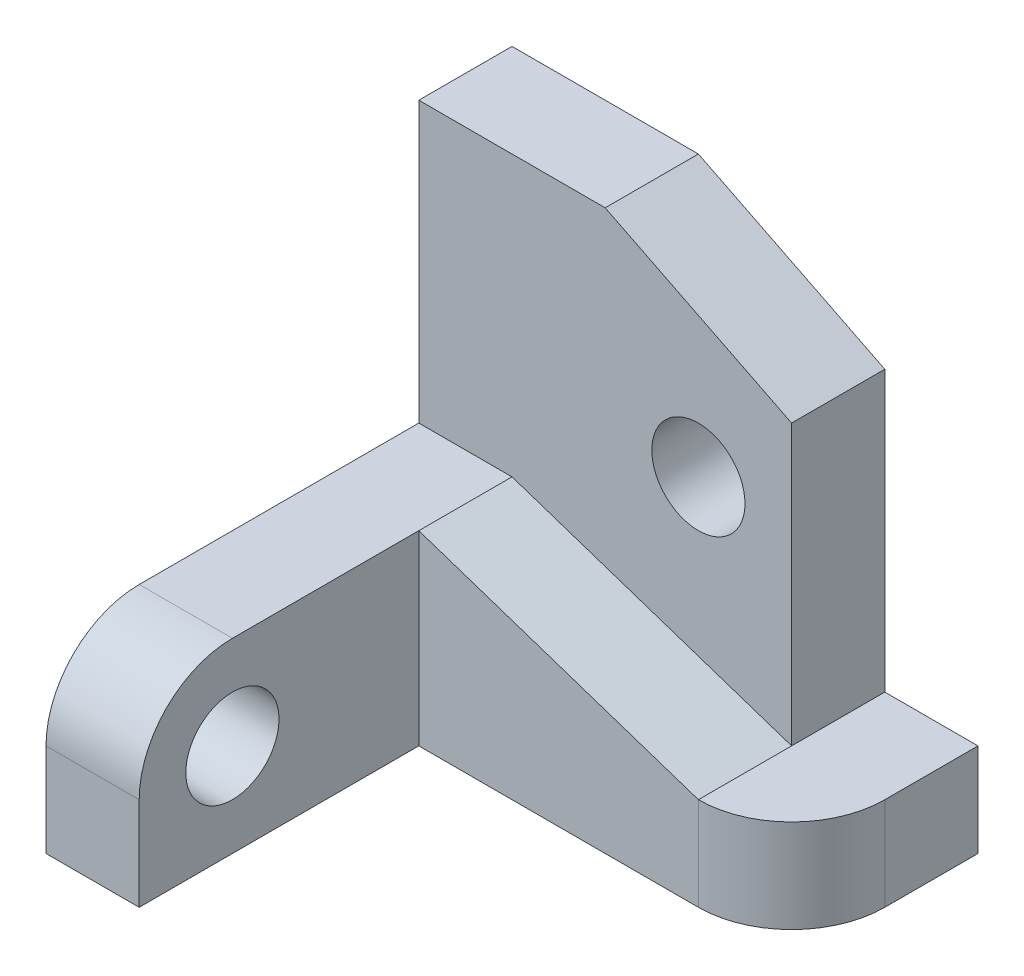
from build123d import *

# Parameters (mm, degrees)
SKETCH2_R      = 5
EXTRUDE1_DEPTH = 10
EXTRUDE2_DEPTH = 20
SKETCH_2_W     = 10
SKETCH_2_H     = 20
EXTRUDE3_DEPTH = 50
SKETCH3_R      = 5
EXTRUDE4_DEPTH = 50
FILLET1_R      = 10


with BuildPart() as part:
    # Sketch2 → Extrude1 (new body)
    with BuildSketch(Plane.XY):
        Polygon((40, 40), (40, 10), (10, 20), (0, 20), (0, 50), (20, 50), align=None)
        with Locations((30, 30)):
            Circle(SKETCH2_R, mode=Mode.SUBTRACT)
    extrude(amount=EXTRUDE1_DEPTH)

    # Sketch → Extrude2 (add)
    with BuildSketch(Plane.XY):
        Polygon((10, 20), (10, 0), (50, 0), (50, 10), (40, 10), align=None)
    extrude(amount=EXTRUDE2_DEPTH)

    # Sketch 2 → Extrude3 (add)
    with BuildSketch(Plane.XY):
        with Locations((5, 10)):
            Rectangle(SKETCH_2_W, SKETCH_2_H)
    extrude(amount=EXTRUDE3_DEPTH)

    # Sketch3 → Extrude4 (cut)
    with BuildSketch(Plane(origin=(10, 0, 0), x_dir=(0, 0, -1), z_dir=(1, 0, 0))):
        with Locations((-40, 10)):
            Circle(SKETCH3_R)
    extrude(amount=-EXTRUDE4_DEPTH, mode=Mode.SUBTRACT)

    # Fillet1
    fillet1_edges = [part.edges().sort_by_distance(p)[0] for p in [
        (5, 20, 50),
        (50, 5, 20),
    ]]
    fillet(fillet1_edges, radius=FILLET1_R)


solid = part.part
